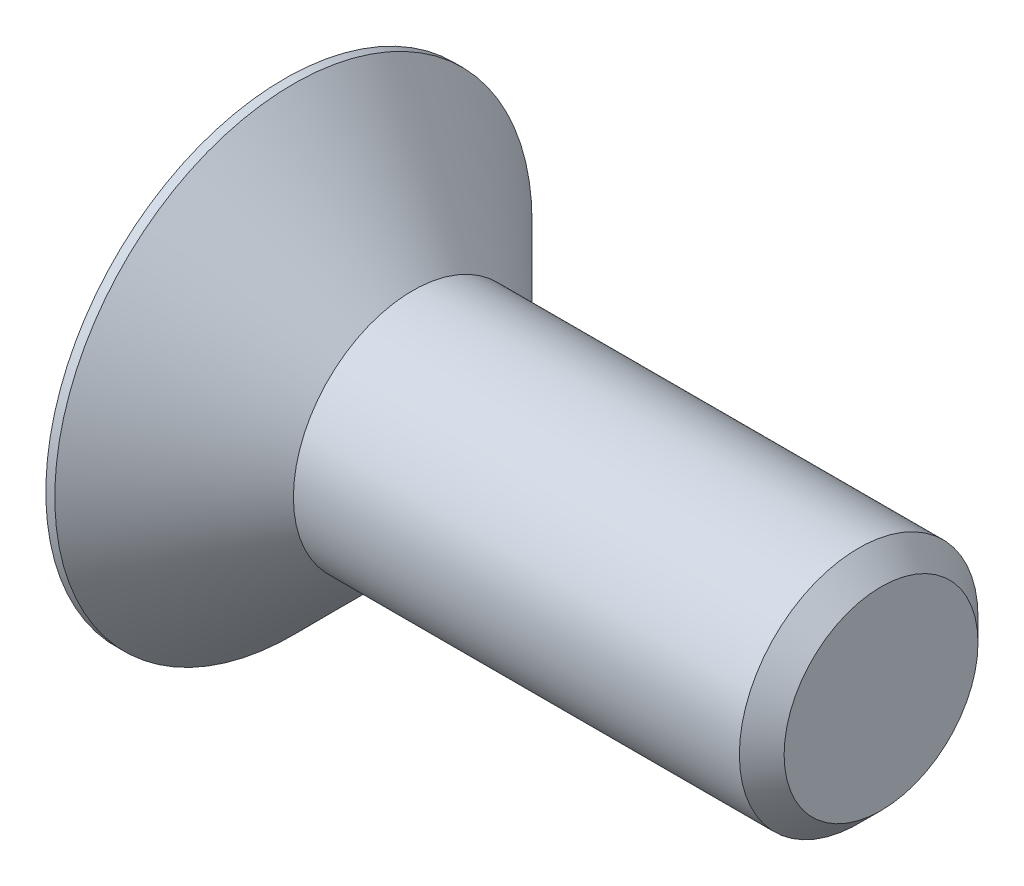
ISO-10303-21;
HEADER;
FILE_DESCRIPTION(('STEP AP214'),'2;1');
FILE_NAME('part.step','',(''),(''),'','','');
FILE_SCHEMA(('AUTOMOTIVE_DESIGN { 1 0 10303 214 1 1 1 1 }'));
ENDSEC;
DATA;
#1=APPLICATION_CONTEXT('core data for automotive mechanical design processes');
#2=APPLICATION_PROTOCOL_DEFINITION('international standard','automotive_design',2000,#1);
#3=PRODUCT_CONTEXT('',#1,'mechanical');
#4=PRODUCT('Part','Part','',(#3));
#5=PRODUCT_RELATED_PRODUCT_CATEGORY('part','',(#4));
#6=PRODUCT_DEFINITION_FORMATION('','',#4);
#7=PRODUCT_DEFINITION_CONTEXT('part definition',#1,'design');
#8=PRODUCT_DEFINITION('design','',#6,#7);
#9=PRODUCT_DEFINITION_SHAPE('','',#8);
#10=(LENGTH_UNIT() NAMED_UNIT(*) SI_UNIT(.MILLI.,.METRE.));
#11=(NAMED_UNIT(*) PLANE_ANGLE_UNIT() SI_UNIT($,.RADIAN.));
#12=(NAMED_UNIT(*) SI_UNIT($,.STERADIAN.) SOLID_ANGLE_UNIT());
#13=UNCERTAINTY_MEASURE_WITH_UNIT(LENGTH_MEASURE(1.E-05),#10,'distance_accuracy_value','');
#14=(GEOMETRIC_REPRESENTATION_CONTEXT(3) GLOBAL_UNCERTAINTY_ASSIGNED_CONTEXT((#13)) GLOBAL_UNIT_ASSIGNED_CONTEXT((#10,
#11,#12)) REPRESENTATION_CONTEXT('',''));
#15=CARTESIAN_POINT('',(0.,0.,0.));
#16=DIRECTION('',(0.,0.,1.));
#17=DIRECTION('',(1.,0.,0.));
#18=AXIS2_PLACEMENT_3D('',#15,#16,#17);
#19=CARTESIAN_POINT('',(4.5,0.,0.));
#20=DIRECTION('',(1.,0.,0.));
#21=DIRECTION('',(0.,0.,-1.));
#22=AXIS2_PLACEMENT_3D('',#19,#20,#21);
#23=PLANE('',#22);
#24=DIRECTION('',(0.,-0.866025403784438,-0.500000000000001));
#25=VECTOR('',#24,1.);
#26=CARTESIAN_POINT('',(4.5,1.5,-2.59807621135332));
#27=LINE('',#26,#25);
#28=CARTESIAN_POINT('',(4.5,0.,-3.46410161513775));
#29=VERTEX_POINT('',#28);
#30=CARTESIAN_POINT('',(4.5,3.,-1.73205080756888));
#31=VERTEX_POINT('',#30);
#32=EDGE_CURVE('E66',#29,#31,#27,.F.);
#33=ORIENTED_EDGE('',*,*,#32,.F.);
#34=DIRECTION('',(0.,-0.866025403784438,0.500000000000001));
#35=VECTOR('',#34,1.);
#36=CARTESIAN_POINT('',(4.5,-1.5,-2.59807621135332));
#37=LINE('',#36,#35);
#38=CARTESIAN_POINT('',(4.5,-3.,-1.73205080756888));
#39=VERTEX_POINT('',#38);
#40=EDGE_CURVE('E71',#39,#29,#37,.F.);
#41=ORIENTED_EDGE('',*,*,#40,.F.);
#42=DIRECTION('',(0.,0.,1.));
#43=VECTOR('',#42,1.);
#44=CARTESIAN_POINT('',(4.5,-3.,0.));
#45=LINE('',#44,#43);
#46=CARTESIAN_POINT('',(4.5,-3.,1.73205080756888));
#47=VERTEX_POINT('',#46);
#48=EDGE_CURVE('E122',#47,#39,#45,.F.);
#49=ORIENTED_EDGE('',*,*,#48,.F.);
#50=DIRECTION('',(0.,0.866025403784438,0.500000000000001));
#51=VECTOR('',#50,1.);
#52=CARTESIAN_POINT('',(4.5,-1.5,2.59807621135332));
#53=LINE('',#52,#51);
#54=CARTESIAN_POINT('',(4.5,0.,3.46410161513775));
#55=VERTEX_POINT('',#54);
#56=EDGE_CURVE('E125',#55,#47,#53,.F.);
#57=ORIENTED_EDGE('',*,*,#56,.F.);
#58=DIRECTION('',(0.,0.866025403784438,-0.500000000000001));
#59=VECTOR('',#58,1.);
#60=CARTESIAN_POINT('',(4.5,1.5,2.59807621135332));
#61=LINE('',#60,#59);
#62=CARTESIAN_POINT('',(4.5,3.,1.73205080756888));
#63=VERTEX_POINT('',#62);
#64=EDGE_CURVE('E130',#63,#55,#61,.F.);
#65=ORIENTED_EDGE('',*,*,#64,.F.);
#66=DIRECTION('',(0.,0.,-1.));
#67=VECTOR('',#66,1.);
#68=CARTESIAN_POINT('',(4.5,3.,0.));
#69=LINE('',#68,#67);
#70=EDGE_CURVE('E82',#31,#63,#69,.F.);
#71=ORIENTED_EDGE('',*,*,#70,.F.);
#72=EDGE_LOOP('',(#33,#41,#49,#57,#65,#71));
#73=FACE_BOUND('',#72,.T.);
#74=ADVANCED_FACE('F16',(#73),#23,.F.);
#75=CARTESIAN_POINT('',(2.25,-1.5,-2.59807621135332));
#76=DIRECTION('',(0.,0.500000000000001,0.866025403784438));
#77=DIRECTION('',(0.,-0.866025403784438,0.500000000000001));
#78=AXIS2_PLACEMENT_3D('',#75,#76,#77);
#79=PLANE('',#78);
#80=DIRECTION('',(1.,0.,0.));
#81=VECTOR('',#80,1.);
#82=CARTESIAN_POINT('',(2.25,0.,-3.46410161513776));
#83=LINE('',#82,#81);
#84=CARTESIAN_POINT('',(0.,0.,-3.46410161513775));
#85=VERTEX_POINT('',#84);
#86=EDGE_CURVE('E73',#85,#29,#83,.T.);
#87=ORIENTED_EDGE('',*,*,#86,.F.);
#88=DIRECTION('',(0.,0.86602540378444,-0.499999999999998));
#89=VECTOR('',#88,1.);
#90=CARTESIAN_POINT('',(0.,-3.,-1.73205080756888));
#91=LINE('',#90,#89);
#92=CARTESIAN_POINT('',(0.,-3.,-1.73205080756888));
#93=VERTEX_POINT('',#92);
#94=EDGE_CURVE('E119',#93,#85,#91,.T.);
#95=ORIENTED_EDGE('',*,*,#94,.F.);
#96=DIRECTION('',(1.,0.,0.));
#97=VECTOR('',#96,1.);
#98=CARTESIAN_POINT('',(2.25,-3.,-1.73205080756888));
#99=LINE('',#98,#97);
#100=EDGE_CURVE('E76',#39,#93,#99,.F.);
#101=ORIENTED_EDGE('',*,*,#100,.F.);
#102=ORIENTED_EDGE('',*,*,#40,.T.);
#103=EDGE_LOOP('',(#87,#95,#101,#102));
#104=FACE_BOUND('',#103,.T.);
#105=ADVANCED_FACE('F72',(#104),#79,.T.);
#106=CARTESIAN_POINT('',(2.25,1.5,-2.59807621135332));
#107=DIRECTION('',(0.,-0.500000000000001,0.866025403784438));
#108=DIRECTION('',(0.,-0.866025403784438,-0.500000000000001));
#109=AXIS2_PLACEMENT_3D('',#106,#107,#108);
#110=PLANE('',#109);
#111=DIRECTION('',(1.,0.,0.));
#112=VECTOR('',#111,1.);
#113=CARTESIAN_POINT('',(2.25,3.,-1.73205080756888));
#114=LINE('',#113,#112);
#115=CARTESIAN_POINT('',(0.,3.,-1.73205080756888));
#116=VERTEX_POINT('',#115);
#117=EDGE_CURVE('E84',#116,#31,#114,.T.);
#118=ORIENTED_EDGE('',*,*,#117,.F.);
#119=DIRECTION('',(0.,0.86602540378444,0.499999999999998));
#120=VECTOR('',#119,1.);
#121=CARTESIAN_POINT('',(0.,0.,-3.46410161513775));
#122=LINE('',#121,#120);
#123=EDGE_CURVE('E88',#85,#116,#122,.T.);
#124=ORIENTED_EDGE('',*,*,#123,.F.);
#125=ORIENTED_EDGE('',*,*,#86,.T.);
#126=ORIENTED_EDGE('',*,*,#32,.T.);
#127=EDGE_LOOP('',(#118,#124,#125,#126));
#128=FACE_BOUND('',#127,.T.);
#129=ADVANCED_FACE('F86',(#128),#110,.T.);
#130=CARTESIAN_POINT('',(2.25,3.,0.));
#131=DIRECTION('',(0.,-1.,0.));
#132=DIRECTION('',(0.,0.,-1.));
#133=AXIS2_PLACEMENT_3D('',#130,#131,#132);
#134=PLANE('',#133);
#135=DIRECTION('',(1.,0.,0.));
#136=VECTOR('',#135,1.);
#137=CARTESIAN_POINT('',(2.25,3.,1.73205080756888));
#138=LINE('',#137,#136);
#139=CARTESIAN_POINT('',(0.,3.,1.73205080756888));
#140=VERTEX_POINT('',#139);
#141=EDGE_CURVE('E132',#140,#63,#138,.T.);
#142=ORIENTED_EDGE('',*,*,#141,.F.);
#143=DIRECTION('',(0.,0.,1.));
#144=VECTOR('',#143,1.);
#145=CARTESIAN_POINT('',(0.,3.,0.));
#146=LINE('',#145,#144);
#147=EDGE_CURVE('E115',#116,#140,#146,.T.);
#148=ORIENTED_EDGE('',*,*,#147,.F.);
#149=ORIENTED_EDGE('',*,*,#117,.T.);
#150=ORIENTED_EDGE('',*,*,#70,.T.);
#151=EDGE_LOOP('',(#142,#148,#149,#150));
#152=FACE_BOUND('',#151,.T.);
#153=ADVANCED_FACE('F137',(#152),#134,.T.);
#154=CARTESIAN_POINT('',(2.25,1.5,2.59807621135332));
#155=DIRECTION('',(0.,-0.500000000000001,-0.866025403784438));
#156=DIRECTION('',(0.,0.866025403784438,-0.500000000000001));
#157=AXIS2_PLACEMENT_3D('',#154,#155,#156);
#158=PLANE('',#157);
#159=DIRECTION('',(1.,0.,0.));
#160=VECTOR('',#159,1.);
#161=CARTESIAN_POINT('',(2.25,0.,3.46410161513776));
#162=LINE('',#161,#160);
#163=CARTESIAN_POINT('',(0.,0.,3.46410161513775));
#164=VERTEX_POINT('',#163);
#165=EDGE_CURVE('E127',#164,#55,#162,.T.);
#166=ORIENTED_EDGE('',*,*,#165,.F.);
#167=DIRECTION('',(0.,-0.86602540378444,0.499999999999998));
#168=VECTOR('',#167,1.);
#169=CARTESIAN_POINT('',(0.,3.,1.73205080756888));
#170=LINE('',#169,#168);
#171=EDGE_CURVE('E108',#140,#164,#170,.T.);
#172=ORIENTED_EDGE('',*,*,#171,.F.);
#173=ORIENTED_EDGE('',*,*,#141,.T.);
#174=ORIENTED_EDGE('',*,*,#64,.T.);
#175=EDGE_LOOP('',(#166,#172,#173,#174));
#176=FACE_BOUND('',#175,.T.);
#177=ADVANCED_FACE('F146',(#176),#158,.T.);
#178=CARTESIAN_POINT('',(2.25,-1.5,2.59807621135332));
#179=DIRECTION('',(0.,0.500000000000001,-0.866025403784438));
#180=DIRECTION('',(0.,0.866025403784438,0.500000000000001));
#181=AXIS2_PLACEMENT_3D('',#178,#179,#180);
#182=PLANE('',#181);
#183=DIRECTION('',(1.,0.,0.));
#184=VECTOR('',#183,1.);
#185=CARTESIAN_POINT('',(2.25,-3.,1.73205080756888));
#186=LINE('',#185,#184);
#187=CARTESIAN_POINT('',(0.,-3.,1.73205080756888));
#188=VERTEX_POINT('',#187);
#189=EDGE_CURVE('E34',#188,#47,#186,.T.);
#190=ORIENTED_EDGE('',*,*,#189,.F.);
#191=DIRECTION('',(0.,-0.86602540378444,-0.499999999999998));
#192=VECTOR('',#191,1.);
#193=CARTESIAN_POINT('',(0.,0.,3.46410161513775));
#194=LINE('',#193,#192);
#195=EDGE_CURVE('E104',#164,#188,#194,.T.);
#196=ORIENTED_EDGE('',*,*,#195,.F.);
#197=ORIENTED_EDGE('',*,*,#165,.T.);
#198=ORIENTED_EDGE('',*,*,#56,.T.);
#199=EDGE_LOOP('',(#190,#196,#197,#198));
#200=FACE_BOUND('',#199,.T.);
#201=ADVANCED_FACE('F144',(#200),#182,.T.);
#202=CARTESIAN_POINT('',(2.25,-3.,0.));
#203=DIRECTION('',(0.,1.,0.));
#204=DIRECTION('',(0.,0.,1.));
#205=AXIS2_PLACEMENT_3D('',#202,#203,#204);
#206=PLANE('',#205);
#207=ORIENTED_EDGE('',*,*,#100,.T.);
#208=DIRECTION('',(0.,0.,1.));
#209=VECTOR('',#208,1.);
#210=CARTESIAN_POINT('',(0.,-3.,0.));
#211=LINE('',#210,#209);
#212=EDGE_CURVE('E100',#188,#93,#211,.F.);
#213=ORIENTED_EDGE('',*,*,#212,.F.);
#214=ORIENTED_EDGE('',*,*,#189,.T.);
#215=ORIENTED_EDGE('',*,*,#48,.T.);
#216=EDGE_LOOP('',(#207,#213,#214,#215));
#217=FACE_BOUND('',#216,.T.);
#218=ADVANCED_FACE('F142',(#217),#206,.T.);
#219=CARTESIAN_POINT('',(0.,0.,0.));
#220=DIRECTION('',(-1.,0.,0.));
#221=DIRECTION('',(0.,0.,1.));
#222=AXIS2_PLACEMENT_3D('',#219,#220,#221);
#223=PLANE('',#222);
#224=ORIENTED_EDGE('',*,*,#195,.T.);
#225=ORIENTED_EDGE('',*,*,#212,.T.);
#226=ORIENTED_EDGE('',*,*,#94,.T.);
#227=ORIENTED_EDGE('',*,*,#123,.T.);
#228=ORIENTED_EDGE('',*,*,#147,.T.);
#229=ORIENTED_EDGE('',*,*,#171,.T.);
#230=EDGE_LOOP('',(#224,#225,#226,#227,#228,#229));
#231=FACE_BOUND('',#230,.T.);
#232=CARTESIAN_POINT('',(0.,0.,0.));
#233=DIRECTION('',(1.,0.,0.));
#234=DIRECTION('',(0.,0.,-1.));
#235=AXIS2_PLACEMENT_3D('',#232,#233,#234);
#236=CIRCLE('',#235,8.);
#237=CARTESIAN_POINT('',(0.,0.,-8.));
#238=VERTEX_POINT('',#237);
#239=EDGE_CURVE('E19',#238,#238,#236,.T.);
#240=ORIENTED_EDGE('',*,*,#239,.F.);
#241=EDGE_LOOP('',(#240));
#242=FACE_BOUND('',#241,.T.);
#243=ADVANCED_FACE('F139',(#231,#242),#223,.T.);
#244=CARTESIAN_POINT('',(20.,0.,0.));
#245=DIRECTION('',(-1.,0.,0.));
#246=DIRECTION('',(0.,0.,1.));
#247=AXIS2_PLACEMENT_3D('',#244,#245,#246);
#248=PLANE('',#247);
#249=CARTESIAN_POINT('',(19.9999999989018,0.,0.));
#250=DIRECTION('',(-1.,0.,0.));
#251=DIRECTION('',(0.,0.,1.));
#252=AXIS2_PLACEMENT_3D('',#249,#250,#251);
#253=CIRCLE('',#252,3.24999999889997);
#254=CARTESIAN_POINT('',(19.9999999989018,0.,3.24999999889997));
#255=VERTEX_POINT('',#254);
#256=EDGE_CURVE('E92',#255,#255,#253,.T.);
#257=ORIENTED_EDGE('',*,*,#256,.F.);
#258=EDGE_LOOP('',(#257));
#259=FACE_BOUND('',#258,.T.);
#260=ADVANCED_FACE('F175',(#259),#248,.F.);
#261=CARTESIAN_POINT('',(0.15,0.,0.));
#262=DIRECTION('',(1.,0.,0.));
#263=DIRECTION('',(0.,0.,-1.));
#264=AXIS2_PLACEMENT_3D('',#261,#262,#263);
#265=CYLINDRICAL_SURFACE('',#264,8.);
#266=CARTESIAN_POINT('',(0.299999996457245,0.,0.));
#267=DIRECTION('',(-1.,0.,0.));
#268=DIRECTION('',(0.,0.,-1.));
#269=AXIS2_PLACEMENT_3D('',#266,#267,#268);
#270=CIRCLE('',#269,7.99999999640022);
#271=CARTESIAN_POINT('',(0.299999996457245,0.,-7.99999999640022));
#272=VERTEX_POINT('',#271);
#273=EDGE_CURVE('E94',#272,#272,#270,.F.);
#274=ORIENTED_EDGE('',*,*,#273,.F.);
#275=EDGE_LOOP('',(#274));
#276=FACE_BOUND('',#275,.T.);
#277=ORIENTED_EDGE('',*,*,#239,.T.);
#278=EDGE_LOOP('',(#277));
#279=FACE_BOUND('',#278,.T.);
#280=ADVANCED_FACE('F171',(#276,#279),#265,.T.);
#281=CARTESIAN_POINT('',(19.2499999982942,0.,0.));
#282=DIRECTION('',(-1.,0.,0.));
#283=DIRECTION('',(0.,0.,1.));
#284=AXIS2_PLACEMENT_3D('',#281,#282,#283);
#285=CONICAL_SURFACE('',#284,3.99999999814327,0.785398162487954);
#286=CARTESIAN_POINT('',(19.25,0.,0.));
#287=DIRECTION('',(1.,0.,0.));
#288=DIRECTION('',(0.,0.,-1.));
#289=AXIS2_PLACEMENT_3D('',#286,#287,#288);
#290=CIRCLE('',#289,4.);
#291=CARTESIAN_POINT('',(19.25,0.,-4.));
#292=VERTEX_POINT('',#291);
#293=EDGE_CURVE('E25',#292,#292,#290,.F.);
#294=ORIENTED_EDGE('',*,*,#293,.F.);
#295=EDGE_LOOP('',(#294));
#296=FACE_BOUND('',#295,.T.);
#297=ORIENTED_EDGE('',*,*,#256,.T.);
#298=EDGE_LOOP('',(#297));
#299=FACE_BOUND('',#298,.T.);
#300=ADVANCED_FACE('F164',(#296,#299),#285,.T.);
#301=CARTESIAN_POINT('',(0.299999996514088,0.,0.));
#302=DIRECTION('',(-1.,0.,0.));
#303=DIRECTION('',(0.,0.,1.));
#304=AXIS2_PLACEMENT_3D('',#301,#302,#303);
#305=CONICAL_SURFACE('',#304,7.99999999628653,0.785398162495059);
#306=ORIENTED_EDGE('',*,*,#273,.T.);
#307=EDGE_LOOP('',(#306));
#308=FACE_BOUND('',#307,.T.);
#309=CARTESIAN_POINT('',(4.3,0.,0.));
#310=DIRECTION('',(1.,0.,0.));
#311=DIRECTION('',(0.,0.,-1.));
#312=AXIS2_PLACEMENT_3D('',#309,#310,#311);
#313=CIRCLE('',#312,4.);
#314=CARTESIAN_POINT('',(4.3,0.,-4.));
#315=VERTEX_POINT('',#314);
#316=EDGE_CURVE('E11',#315,#315,#313,.T.);
#317=ORIENTED_EDGE('',*,*,#316,.F.);
#318=EDGE_LOOP('',(#317));
#319=FACE_BOUND('',#318,.T.);
#320=ADVANCED_FACE('F158',(#308,#319),#305,.T.);
#321=CARTESIAN_POINT('',(9.625,0.,0.));
#322=DIRECTION('',(1.,0.,0.));
#323=DIRECTION('',(0.,0.,-1.));
#324=AXIS2_PLACEMENT_3D('',#321,#322,#323);
#325=CYLINDRICAL_SURFACE('',#324,4.);
#326=ORIENTED_EDGE('',*,*,#316,.T.);
#327=EDGE_LOOP('',(#326));
#328=FACE_BOUND('',#327,.T.);
#329=ORIENTED_EDGE('',*,*,#293,.T.);
#330=EDGE_LOOP('',(#329));
#331=FACE_BOUND('',#330,.T.);
#332=ADVANCED_FACE('F156',(#328,#331),#325,.T.);
#333=CLOSED_SHELL('',(#74,#105,#129,#153,#177,#201,#218,#243,#260,#280,#300,#320,#332));
#334=MANIFOLD_SOLID_BREP('B1',#333);
#335=ADVANCED_BREP_SHAPE_REPRESENTATION('',(#18,#334),#14);
#336=SHAPE_DEFINITION_REPRESENTATION(#9,#335);
ENDSEC;
END-ISO-10303-21;
